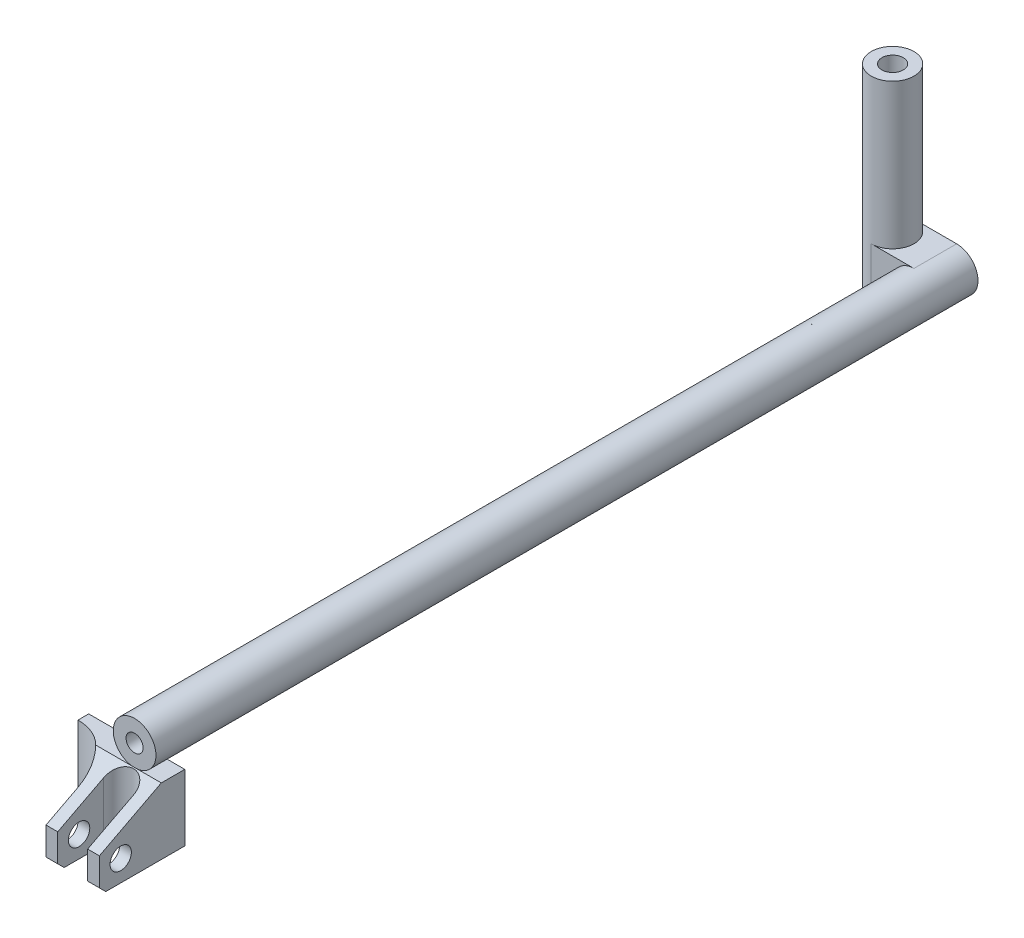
ISO-10303-21;
HEADER;
FILE_DESCRIPTION(('STEP AP214'),'2;1');
FILE_NAME('part.step','',(''),(''),'','','');
FILE_SCHEMA(('AUTOMOTIVE_DESIGN { 1 0 10303 214 1 1 1 1 }'));
ENDSEC;
DATA;
#1=APPLICATION_CONTEXT('core data for automotive mechanical design processes');
#2=APPLICATION_PROTOCOL_DEFINITION('international standard','automotive_design',2000,#1);
#3=PRODUCT_CONTEXT('',#1,'mechanical');
#4=PRODUCT('Part','Part','',(#3));
#5=PRODUCT_RELATED_PRODUCT_CATEGORY('part','',(#4));
#6=PRODUCT_DEFINITION_FORMATION('','',#4);
#7=PRODUCT_DEFINITION_CONTEXT('part definition',#1,'design');
#8=PRODUCT_DEFINITION('design','',#6,#7);
#9=PRODUCT_DEFINITION_SHAPE('','',#8);
#10=(LENGTH_UNIT() NAMED_UNIT(*) SI_UNIT(.MILLI.,.METRE.));
#11=(NAMED_UNIT(*) PLANE_ANGLE_UNIT() SI_UNIT($,.RADIAN.));
#12=(NAMED_UNIT(*) SI_UNIT($,.STERADIAN.) SOLID_ANGLE_UNIT());
#13=UNCERTAINTY_MEASURE_WITH_UNIT(LENGTH_MEASURE(1.E-05),#10,'distance_accuracy_value','');
#14=(GEOMETRIC_REPRESENTATION_CONTEXT(3) GLOBAL_UNCERTAINTY_ASSIGNED_CONTEXT((#13)) GLOBAL_UNIT_ASSIGNED_CONTEXT((#10,
#11,#12)) REPRESENTATION_CONTEXT('',''));
#15=CARTESIAN_POINT('',(0.,0.,0.));
#16=DIRECTION('',(0.,0.,1.));
#17=DIRECTION('',(1.,0.,0.));
#18=AXIS2_PLACEMENT_3D('',#15,#16,#17);
#19=CARTESIAN_POINT('',(0.,0.,0.));
#20=DIRECTION('',(0.,0.,1.));
#21=DIRECTION('',(1.,0.,0.));
#22=AXIS2_PLACEMENT_3D('',#19,#20,#21);
#23=CYLINDRICAL_SURFACE('',#22,8.);
#24=CARTESIAN_POINT('',(0.,0.,365.));
#25=DIRECTION('',(0.,0.,1.));
#26=DIRECTION('',(1.,0.,0.));
#27=AXIS2_PLACEMENT_3D('',#24,#25,#26);
#28=CIRCLE('',#27,8.);
#29=CARTESIAN_POINT('',(8.,0.,365.));
#30=VERTEX_POINT('',#29);
#31=EDGE_CURVE('E36',#30,#30,#28,.F.);
#32=ORIENTED_EDGE('',*,*,#31,.F.);
#33=EDGE_LOOP('',(#32));
#34=FACE_BOUND('',#33,.T.);
#35=CARTESIAN_POINT('',(-8.,1.11022302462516E-13,5.));
#36=CARTESIAN_POINT('',(-7.99999969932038,-0.127079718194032,5.00000029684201));
#37=CARTESIAN_POINT('',(-7.99696526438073,-0.254165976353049,5.00485122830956));
#38=CARTESIAN_POINT('',(-7.98490163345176,-0.507365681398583,5.02418745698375));
#39=CARTESIAN_POINT('',(-7.97586983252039,-0.633478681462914,5.03867694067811));
#40=CARTESIAN_POINT('',(-7.95201844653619,-0.883879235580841,5.0771121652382));
#41=CARTESIAN_POINT('',(-7.93719071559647,-1.00816396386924,5.10107121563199));
#42=CARTESIAN_POINT('',(-7.9021008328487,-1.2538800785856,5.1581302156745));
#43=CARTESIAN_POINT('',(-7.88183638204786,-1.37531023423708,5.19123403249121));
#44=CARTESIAN_POINT('',(-7.83646507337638,-1.6138367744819,5.2659676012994));
#45=CARTESIAN_POINT('',(-7.81138511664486,-1.73095311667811,5.30755006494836));
#46=CARTESIAN_POINT('',(-7.75685494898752,-1.96091650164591,5.39889847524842));
#47=CARTESIAN_POINT('',(-7.72740304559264,-2.07376186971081,5.44866759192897));
#48=CARTESIAN_POINT('',(-7.63340708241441,-2.40491190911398,5.60949664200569));
#49=CARTESIAN_POINT('',(-7.56316973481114,-2.61609848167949,5.73216345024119));
#50=CARTESIAN_POINT('',(-7.40680295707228,-3.03193014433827,6.01555395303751));
#51=CARTESIAN_POINT('',(-7.31985233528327,-3.23470598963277,6.17853453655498));
#52=CARTESIAN_POINT('',(-7.14124012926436,-3.61195776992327,6.53289939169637));
#53=CARTESIAN_POINT('',(-7.04957232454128,-3.78639500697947,6.72432183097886));
#54=CARTESIAN_POINT('',(-6.90836217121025,-4.03551059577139,7.04428574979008));
#55=CARTESIAN_POINT('',(-6.85772204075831,-4.12074022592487,7.16428713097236));
#56=CARTESIAN_POINT('',(-6.75899646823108,-4.28074637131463,7.41215103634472));
#57=CARTESIAN_POINT('',(-6.7109115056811,-4.35552092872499,7.54001502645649));
#58=CARTESIAN_POINT('',(-6.61907677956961,-4.49385262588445,7.80288418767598));
#59=CARTESIAN_POINT('',(-6.57532033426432,-4.55742717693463,7.93787784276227));
#60=CARTESIAN_POINT('',(-6.49385156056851,-4.67278116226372,8.21462244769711));
#61=CARTESIAN_POINT('',(-6.45613925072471,-4.72456056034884,8.35637341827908));
#62=CARTESIAN_POINT('',(-6.39737739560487,-4.80367778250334,8.60813358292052));
#63=CARTESIAN_POINT('',(-6.37454329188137,-4.83387146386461,8.71683605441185));
#64=CARTESIAN_POINT('',(-6.33391313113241,-4.88698936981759,8.93691914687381));
#65=CARTESIAN_POINT('',(-6.31611593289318,-4.90991524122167,9.04829915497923));
#66=CARTESIAN_POINT('',(-6.2861900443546,-4.94817199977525,9.27297633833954));
#67=CARTESIAN_POINT('',(-6.27405463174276,-4.96351189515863,9.38627107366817));
#68=CARTESIAN_POINT('',(-6.25587655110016,-4.98640391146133,9.61414129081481));
#69=CARTESIAN_POINT('',(-6.2498341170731,-4.99395573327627,9.72871682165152));
#70=CARTESIAN_POINT('',(-6.24407626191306,-5.00115324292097,9.9585586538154));
#71=CARTESIAN_POINT('',(-6.24437637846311,-5.0007795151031,10.0738259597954));
#72=CARTESIAN_POINT('',(-6.25133014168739,-4.99208386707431,10.3039059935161));
#73=CARTESIAN_POINT('',(-6.25798611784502,-4.98375903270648,10.4187185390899));
#74=CARTESIAN_POINT('',(-6.27739584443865,-4.95928874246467,10.6470210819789));
#75=CARTESIAN_POINT('',(-6.29015151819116,-4.94314081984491,10.7605106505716));
#76=CARTESIAN_POINT('',(-6.32127805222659,-4.90327193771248,10.9853862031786));
#77=CARTESIAN_POINT('',(-6.33965123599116,-4.87954784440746,11.0967712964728));
#78=CARTESIAN_POINT('',(-6.4012993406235,-4.79874186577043,11.4216199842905));
#79=CARTESIAN_POINT('',(-6.45162709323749,-4.73140686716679,11.6312924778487));
#80=CARTESIAN_POINT('',(-6.56582416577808,-4.57160139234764,12.0366820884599));
#81=CARTESIAN_POINT('',(-6.62969827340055,-4.4791220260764,12.2323942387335));
#82=CARTESIAN_POINT('',(-6.77818972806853,-4.25180409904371,12.6433146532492));
#83=CARTESIAN_POINT('',(-6.86445305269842,-4.11227978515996,12.855335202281));
#84=CARTESIAN_POINT('',(-7.04023909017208,-3.80349790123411,13.2553491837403));
#85=CARTESIAN_POINT('',(-7.12976507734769,-3.63420977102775,13.443317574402));
#86=CARTESIAN_POINT('',(-7.26825220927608,-3.34462792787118,13.7195685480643));
#87=CARTESIAN_POINT('',(-7.31856628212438,-3.23332743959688,13.816742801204));
#88=CARTESIAN_POINT('',(-7.41651405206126,-3.00184758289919,14.0013511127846));
#89=CARTESIAN_POINT('',(-7.46414873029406,-2.88167150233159,14.0887887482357));
#90=CARTESIAN_POINT('',(-7.55548277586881,-2.63291547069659,14.2532332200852));
#91=CARTESIAN_POINT('',(-7.59918109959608,-2.5043333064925,14.3302372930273));
#92=CARTESIAN_POINT('',(-7.6813840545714,-2.23953943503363,14.4729252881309));
#93=CARTESIAN_POINT('',(-7.71989188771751,-2.10333250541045,14.5386161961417));
#94=CARTESIAN_POINT('',(-7.78870197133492,-1.83158498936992,14.6546688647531));
#95=CARTESIAN_POINT('',(-7.81933279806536,-1.69639792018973,14.7056622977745));
#96=CARTESIAN_POINT('',(-7.87404113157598,-1.42097512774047,14.796020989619));
#97=CARTESIAN_POINT('',(-7.89812238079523,-1.28074233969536,14.8353928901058));
#98=CARTESIAN_POINT('',(-7.93899345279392,-0.996484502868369,14.9018673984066));
#99=CARTESIAN_POINT('',(-7.95578983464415,-0.852462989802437,14.9289810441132));
#100=CARTESIAN_POINT('',(-7.98157299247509,-0.561915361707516,14.970490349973));
#101=CARTESIAN_POINT('',(-7.99056110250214,-0.415389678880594,14.9848881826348));
#102=CARTESIAN_POINT('',(-7.99969867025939,-0.143238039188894,14.999520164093));
#103=CARTESIAN_POINT('',(-8.00096292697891,-0.0177414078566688,15.001540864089));
#104=CARTESIAN_POINT('',(-7.99758945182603,0.232966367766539,14.9961427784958));
#105=CARTESIAN_POINT('',(-7.99295210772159,0.358177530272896,14.9887246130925));
#106=CARTESIAN_POINT('',(-7.97789005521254,0.607327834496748,14.9645562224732));
#107=CARTESIAN_POINT('',(-7.96746586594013,0.731267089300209,14.9478068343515));
#108=CARTESIAN_POINT('',(-7.94108300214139,0.976969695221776,14.9052093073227));
#109=CARTESIAN_POINT('',(-7.92512423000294,1.09873300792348,14.87936100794));
#110=CARTESIAN_POINT('',(-7.88877344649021,1.33450834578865,14.8200905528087));
#111=CARTESIAN_POINT('',(-7.86858112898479,1.44863666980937,14.7870073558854));
#112=CARTESIAN_POINT('',(-7.8238453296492,1.6735023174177,14.7131109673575));
#113=CARTESIAN_POINT('',(-7.79930036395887,1.7842384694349,14.6722951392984));
#114=CARTESIAN_POINT('',(-7.71984519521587,2.11043845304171,14.5388502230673));
#115=CARTESIAN_POINT('',(-7.65908557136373,2.32007565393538,14.4351772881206));
#116=CARTESIAN_POINT('',(-7.51959499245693,2.74037159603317,14.1899279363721));
#117=CARTESIAN_POINT('',(-7.43966908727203,2.94899750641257,14.0455818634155));
#118=CARTESIAN_POINT('',(-7.27228030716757,3.34056091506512,13.7288284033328));
#119=CARTESIAN_POINT('',(-7.18480911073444,3.52346945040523,13.5563898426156));
#120=CARTESIAN_POINT('',(-6.99623419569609,3.88590040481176,13.1594550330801));
#121=CARTESIAN_POINT('',(-6.8949947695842,4.06107692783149,12.9310356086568));
#122=CARTESIAN_POINT('',(-6.70267107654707,4.37121122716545,12.4445124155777));
#123=CARTESIAN_POINT('',(-6.61157980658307,4.50619684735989,12.186429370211));
#124=CARTESIAN_POINT('',(-6.46933988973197,4.70739703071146,11.7011860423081));
#125=CARTESIAN_POINT('',(-6.41382106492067,4.78209607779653,11.4788842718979));
#126=CARTESIAN_POINT('',(-6.34656596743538,4.87056932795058,11.1364345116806));
#127=CARTESIAN_POINT('',(-6.32682054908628,4.89612834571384,11.0208098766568));
#128=CARTESIAN_POINT('',(-6.29335959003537,4.93906627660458,10.787213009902));
#129=CARTESIAN_POINT('',(-6.27964145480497,4.95644870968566,10.6692418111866));
#130=CARTESIAN_POINT('',(-6.2587264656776,4.98283345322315,10.431062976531));
#131=CARTESIAN_POINT('',(-6.25156939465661,4.99178464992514,10.3108461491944));
#132=CARTESIAN_POINT('',(-6.24422754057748,5.00096567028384,10.0698650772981));
#133=CARTESIAN_POINT('',(-6.24404272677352,5.00119553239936,9.94910083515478));
#134=CARTESIAN_POINT('',(-6.25065867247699,4.99292458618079,9.70802447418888));
#135=CARTESIAN_POINT('',(-6.25746155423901,4.98442112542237,9.58771250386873));
#136=CARTESIAN_POINT('',(-6.27774556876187,4.95884706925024,9.34860633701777));
#137=CARTESIAN_POINT('',(-6.29122660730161,4.94177659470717,9.22981211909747));
#138=CARTESIAN_POINT('',(-6.33822773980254,4.88153513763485,8.89602861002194));
#139=CARTESIAN_POINT('',(-6.37907576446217,4.82847742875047,8.68376223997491));
#140=CARTESIAN_POINT('',(-6.47669777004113,4.69670428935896,8.27142029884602));
#141=CARTESIAN_POINT('',(-6.53347839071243,4.61797815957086,8.07134985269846));
#142=CARTESIAN_POINT('',(-6.66655793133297,4.42410573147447,7.65762443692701));
#143=CARTESIAN_POINT('',(-6.74449249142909,4.30533683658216,7.4461960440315));
#144=CARTESIAN_POINT('',(-6.90670498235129,4.0400096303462,7.04424929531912));
#145=CARTESIAN_POINT('',(-6.99098800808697,3.8934288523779,6.85374804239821));
#146=CARTESIAN_POINT('',(-7.17608994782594,3.54264024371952,6.45991603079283));
#147=CARTESIAN_POINT('',(-7.27687640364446,3.33276887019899,6.26152210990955));
#148=CARTESIAN_POINT('',(-7.42018359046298,2.99268031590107,5.99189976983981));
#149=CARTESIAN_POINT('',(-7.46667962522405,2.8749841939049,5.90662168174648));
#150=CARTESIAN_POINT('',(-7.5558801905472,2.63162062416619,5.7460851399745));
#151=CARTESIAN_POINT('',(-7.59858669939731,2.5059573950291,5.67082144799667));
#152=CARTESIAN_POINT('',(-7.67916888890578,2.24695585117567,5.53089372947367));
#153=CARTESIAN_POINT('',(-7.71703260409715,2.11359966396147,5.46625584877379));
#154=CARTESIAN_POINT('',(-7.78670745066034,1.84039127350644,5.34864993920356));
#155=CARTESIAN_POINT('',(-7.81852207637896,1.70054287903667,5.2956751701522));
#156=CARTESIAN_POINT('',(-7.87506644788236,1.41574969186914,5.20228711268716));
#157=CARTESIAN_POINT('',(-7.89981525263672,1.27081981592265,5.16184000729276));
#158=CARTESIAN_POINT('',(-7.94151359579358,0.976912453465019,5.09404896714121));
#159=CARTESIAN_POINT('',(-7.95846888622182,0.827938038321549,5.06669536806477));
#160=CARTESIAN_POINT('',(-7.9807660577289,0.56570803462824,5.03081849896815));
#161=CARTESIAN_POINT('',(-7.98796542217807,0.453012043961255,5.01927449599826));
#162=CARTESIAN_POINT('',(-7.99758267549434,0.226879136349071,5.00386487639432));
#163=CARTESIAN_POINT('',(-8.00000026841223,0.113442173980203,4.99999973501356));
#164=CARTESIAN_POINT('',(-8.,1.11022302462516E-13,5.));
#165=B_SPLINE_CURVE_WITH_KNOTS('',3,(#35,#36,#37,#38,#39,#40,#41,#42,#43,#44,#45,#46,#47,#48,
#49,#50,#51,#52,#53,#54,#55,#56,#57,#58,#59,#60,#61,#62,#63,#64,#65,#66,#67,#68,#69,#70,#71,#72,
#73,#74,#75,#76,#77,#78,#79,#80,#81,#82,#83,#84,#85,#86,#87,#88,#89,#90,#91,#92,#93,#94,#95,#96,
#97,#98,#99,#100,#101,#102,#103,#104,#105,#106,#107,#108,#109,#110,#111,#112,#113,#114,#115,
#116,#117,#118,#119,#120,#121,#122,#123,#124,#125,#126,#127,#128,#129,#130,#131,#132,#133,#134,
#135,#136,#137,#138,#139,#140,#141,#142,#143,#144,#145,#146,#147,#148,#149,#150,#151,#152,#153,
#154,#155,#156,#157,#158,#159,#160,#161,#162,#163,#164),.UNSPECIFIED.,.T.,.F.,(4,2,2,2,2,2,2,2,
2,2,2,2,2,2,2,2,2,2,2,2,2,2,2,2,2,2,2,2,2,2,2,2,2,2,2,2,2,2,2,2,2,2,2,2,2,2,2,2,2,2,2,2,2,2,2,2,
2,2,2,2,2,2,2,2,4),(0.,0.381122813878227,0.762411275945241,1.14423755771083,1.52622555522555,
1.90613865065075,2.28619920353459,3.04547146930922,3.86537873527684,4.68639638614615,
5.15288943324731,5.61946971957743,6.0853181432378,6.55116799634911,6.89615022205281,
7.24105422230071,7.58554766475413,7.93005433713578,8.27540506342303,8.62088241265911,
8.96646876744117,9.31219825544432,9.98712845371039,10.6622975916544,11.463592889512,
12.2657157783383,12.7334704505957,13.2010527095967,13.6687585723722,14.1361745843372,
14.5786070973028,15.0207862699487,15.4625664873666,15.9042712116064,16.280349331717,
16.6564027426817,17.0324224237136,17.4084487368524,17.7696430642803,18.1309607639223,
18.8530325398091,19.6479898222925,20.4438353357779,21.355208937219,22.2659496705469,
22.9857781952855,23.3455439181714,23.705154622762,24.0669316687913,24.4287071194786,
24.7905924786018,25.1524727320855,25.8172983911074,26.4824015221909,27.2437925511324,
28.005801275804,28.9187931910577,29.3761295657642,29.8332257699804,30.2914303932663,
30.749369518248,31.2060614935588,31.6624158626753,32.0026174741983,32.3428401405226),.UNSPECIFIED.);
#166=CARTESIAN_POINT('',(-8.,1.11022302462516E-13,5.));
#167=VERTEX_POINT('',#166);
#168=EDGE_CURVE('E195',#167,#167,#165,.T.);
#169=ORIENTED_EDGE('',*,*,#168,.T.);
#170=EDGE_LOOP('',(#169));
#171=FACE_BOUND('',#170,.T.);
#172=CARTESIAN_POINT('',(0.,0.,3.));
#173=DIRECTION('',(0.,0.,-1.));
#174=DIRECTION('',(-1.,0.,0.));
#175=AXIS2_PLACEMENT_3D('',#172,#173,#174);
#176=CIRCLE('',#175,8.);
#177=CARTESIAN_POINT('',(-8.,0.,3.));
#178=VERTEX_POINT('',#177);
#179=EDGE_CURVE('E11',#178,#178,#176,.F.);
#180=ORIENTED_EDGE('',*,*,#179,.F.);
#181=EDGE_LOOP('',(#180));
#182=FACE_BOUND('',#181,.T.);
#183=ADVANCED_FACE('F28',(#34,#171,#182),#23,.F.);
#184=CARTESIAN_POINT('',(-25.,1.11022302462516E-13,10.));
#185=DIRECTION('',(1.,0.,0.));
#186=DIRECTION('',(0.,0.,-1.));
#187=AXIS2_PLACEMENT_3D('',#184,#185,#186);
#188=CYLINDRICAL_SURFACE('',#187,5.);
#189=ORIENTED_EDGE('',*,*,#168,.F.);
#190=EDGE_LOOP('',(#189));
#191=FACE_BOUND('',#190,.T.);
#192=CARTESIAN_POINT('',(-20.,1.11022302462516E-13,10.));
#193=DIRECTION('',(0.707106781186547,-0.707106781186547,0.));
#194=DIRECTION('',(0.707106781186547,0.707106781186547,0.));
#195=AXIS2_PLACEMENT_3D('',#192,#193,#194);
#196=ELLIPSE('',#195,7.07106781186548,5.);
#197=CARTESIAN_POINT('',(-20.,1.11022302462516E-13,15.));
#198=VERTEX_POINT('',#197);
#199=CARTESIAN_POINT('',(-20.,1.11022302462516E-13,5.));
#200=VERTEX_POINT('',#199);
#201=EDGE_CURVE('E187',#198,#200,#196,.F.);
#202=ORIENTED_EDGE('',*,*,#201,.T.);
#203=CARTESIAN_POINT('',(-20.,1.11022302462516E-13,10.));
#204=DIRECTION('',(0.707106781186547,0.707106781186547,0.));
#205=DIRECTION('',(0.707106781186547,-0.707106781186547,0.));
#206=AXIS2_PLACEMENT_3D('',#203,#204,#205);
#207=ELLIPSE('',#206,7.07106781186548,5.);
#208=EDGE_CURVE('E190',#200,#198,#207,.F.);
#209=ORIENTED_EDGE('',*,*,#208,.T.);
#210=EDGE_LOOP('',(#202,#209));
#211=FACE_BOUND('',#210,.T.);
#212=ADVANCED_FACE('F387',(#191,#211),#188,.F.);
#213=CARTESIAN_POINT('',(-32.5,-25.,414.));
#214=DIRECTION('',(0.,0.,1.));
#215=DIRECTION('',(1.,0.,0.));
#216=AXIS2_PLACEMENT_3D('',#213,#214,#215);
#217=PLANE('',#216);
#218=DIRECTION('',(0.,1.,0.));
#219=VECTOR('',#218,1.);
#220=CARTESIAN_POINT('',(6.99999999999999,-25.,414.));
#221=LINE('',#220,#219);
#222=CARTESIAN_POINT('',(6.99999999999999,-38.,414.));
#223=VERTEX_POINT('',#222);
#224=CARTESIAN_POINT('',(6.99999999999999,-25.,414.));
#225=VERTEX_POINT('',#224);
#226=EDGE_CURVE('E234',#223,#225,#221,.T.);
#227=ORIENTED_EDGE('',*,*,#226,.F.);
#228=DIRECTION('',(1.,0.,0.));
#229=VECTOR('',#228,1.);
#230=CARTESIAN_POINT('',(-32.5,-38.,414.));
#231=LINE('',#230,#229);
#232=CARTESIAN_POINT('',(12.5,-38.,414.));
#233=VERTEX_POINT('',#232);
#234=EDGE_CURVE('E353',#223,#233,#231,.T.);
#235=ORIENTED_EDGE('',*,*,#234,.T.);
#236=DIRECTION('',(0.,-1.,0.));
#237=VECTOR('',#236,1.);
#238=CARTESIAN_POINT('',(12.5,-25.,414.));
#239=LINE('',#238,#237);
#240=CARTESIAN_POINT('',(12.5,-25.,414.));
#241=VERTEX_POINT('',#240);
#242=EDGE_CURVE('E258',#241,#233,#239,.T.);
#243=ORIENTED_EDGE('',*,*,#242,.F.);
#244=DIRECTION('',(1.,0.,0.));
#245=VECTOR('',#244,1.);
#246=CARTESIAN_POINT('',(-32.5,-25.,414.));
#247=LINE('',#246,#245);
#248=EDGE_CURVE('E285',#225,#241,#247,.T.);
#249=ORIENTED_EDGE('',*,*,#248,.F.);
#250=EDGE_LOOP('',(#227,#235,#243,#249));
#251=FACE_BOUND('',#250,.T.);
#252=ADVANCED_FACE('F408',(#251),#217,.T.);
#253=CARTESIAN_POINT('',(-20.,10.,10.));
#254=DIRECTION('',(0.,1.,0.));
#255=DIRECTION('',(0.,0.,1.));
#256=AXIS2_PLACEMENT_3D('',#253,#254,#255);
#257=PLANE('',#256);
#258=DIRECTION('',(-1.,0.,0.));
#259=VECTOR('',#258,1.);
#260=CARTESIAN_POINT('',(-20.,10.,0.));
#261=LINE('',#260,#259);
#262=CARTESIAN_POINT('',(0.,10.,0.));
#263=VERTEX_POINT('',#262);
#264=CARTESIAN_POINT('',(-20.,10.,0.));
#265=VERTEX_POINT('',#264);
#266=EDGE_CURVE('E320',#263,#265,#261,.T.);
#267=ORIENTED_EDGE('',*,*,#266,.T.);
#268=CARTESIAN_POINT('',(-20.,10.,10.));
#269=DIRECTION('',(0.,1.,0.));
#270=DIRECTION('',(0.,0.,1.));
#271=AXIS2_PLACEMENT_3D('',#268,#269,#270);
#272=CIRCLE('',#271,10.);
#273=CARTESIAN_POINT('',(-20.,10.,20.));
#274=VERTEX_POINT('',#273);
#275=EDGE_CURVE('E293',#274,#265,#272,.T.);
#276=ORIENTED_EDGE('',*,*,#275,.F.);
#277=DIRECTION('',(1.,0.,0.));
#278=VECTOR('',#277,1.);
#279=CARTESIAN_POINT('',(-20.,10.,20.));
#280=LINE('',#279,#278);
#281=CARTESIAN_POINT('',(0.,10.,20.));
#282=VERTEX_POINT('',#281);
#283=EDGE_CURVE('E314',#274,#282,#280,.T.);
#284=ORIENTED_EDGE('',*,*,#283,.T.);
#285=DIRECTION('',(0.,0.,-1.));
#286=VECTOR('',#285,1.);
#287=CARTESIAN_POINT('',(0.,10.,0.));
#288=LINE('',#287,#286);
#289=EDGE_CURVE('E317',#282,#263,#288,.T.);
#290=ORIENTED_EDGE('',*,*,#289,.T.);
#291=EDGE_LOOP('',(#267,#276,#284,#290));
#292=FACE_BOUND('',#291,.T.);
#293=ADVANCED_FACE('F585',(#292),#257,.T.);
#294=CARTESIAN_POINT('',(-20.,-10.,10.));
#295=DIRECTION('',(0.,1.,0.));
#296=DIRECTION('',(0.,0.,1.));
#297=AXIS2_PLACEMENT_3D('',#294,#295,#296);
#298=PLANE('',#297);
#299=CARTESIAN_POINT('',(-20.,-10.,10.));
#300=DIRECTION('',(0.,-1.,0.));
#301=DIRECTION('',(0.,0.,-1.));
#302=AXIS2_PLACEMENT_3D('',#299,#300,#301);
#303=CIRCLE('',#302,10.);
#304=CARTESIAN_POINT('',(-20.,-10.,0.));
#305=VERTEX_POINT('',#304);
#306=CARTESIAN_POINT('',(-20.,-10.,20.));
#307=VERTEX_POINT('',#306);
#308=EDGE_CURVE('E299',#305,#307,#303,.T.);
#309=ORIENTED_EDGE('',*,*,#308,.F.);
#310=DIRECTION('',(-1.,0.,0.));
#311=VECTOR('',#310,1.);
#312=CARTESIAN_POINT('',(-20.,-10.,0.));
#313=LINE('',#312,#311);
#314=CARTESIAN_POINT('',(0.,-10.,0.));
#315=VERTEX_POINT('',#314);
#316=EDGE_CURVE('E311',#315,#305,#313,.T.);
#317=ORIENTED_EDGE('',*,*,#316,.F.);
#318=DIRECTION('',(0.,0.,-1.));
#319=VECTOR('',#318,1.);
#320=CARTESIAN_POINT('',(0.,-10.,0.));
#321=LINE('',#320,#319);
#322=CARTESIAN_POINT('',(0.,-10.,20.));
#323=VERTEX_POINT('',#322);
#324=EDGE_CURVE('E308',#323,#315,#321,.T.);
#325=ORIENTED_EDGE('',*,*,#324,.F.);
#326=DIRECTION('',(1.,0.,0.));
#327=VECTOR('',#326,1.);
#328=CARTESIAN_POINT('',(-20.,-10.,20.));
#329=LINE('',#328,#327);
#330=EDGE_CURVE('E305',#307,#323,#329,.T.);
#331=ORIENTED_EDGE('',*,*,#330,.F.);
#332=EDGE_LOOP('',(#309,#317,#325,#331));
#333=FACE_BOUND('',#332,.T.);
#334=ADVANCED_FACE('F479',(#333),#298,.F.);
#335=CARTESIAN_POINT('',(0.,0.,385.));
#336=DIRECTION('',(0.,0.,-1.));
#337=DIRECTION('',(-1.,0.,0.));
#338=AXIS2_PLACEMENT_3D('',#335,#336,#337);
#339=CYLINDRICAL_SURFACE('',#338,10.);
#340=CARTESIAN_POINT('',(0.,0.,385.));
#341=DIRECTION('',(0.,0.,1.));
#342=DIRECTION('',(1.,0.,0.));
#343=AXIS2_PLACEMENT_3D('',#340,#341,#342);
#344=CIRCLE('',#343,10.);
#345=CARTESIAN_POINT('',(1.26901134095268,-9.91915370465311,385.));
#346=VERTEX_POINT('',#345);
#347=CARTESIAN_POINT('',(-1.26901134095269,-9.91915370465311,385.));
#348=VERTEX_POINT('',#347);
#349=EDGE_CURVE('E329',#346,#348,#344,.T.);
#350=ORIENTED_EDGE('',*,*,#349,.F.);
#351=DIRECTION('',(0.,0.,-1.));
#352=VECTOR('',#351,1.);
#353=CARTESIAN_POINT('',(1.26901134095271,-9.91915370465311,385.));
#354=LINE('',#353,#352);
#355=CARTESIAN_POINT('',(1.26901134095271,-9.9191537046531,374.));
#356=VERTEX_POINT('',#355);
#357=EDGE_CURVE('E290',#346,#356,#354,.T.);
#358=ORIENTED_EDGE('',*,*,#357,.T.);
#359=CARTESIAN_POINT('',(0.,0.,374.));
#360=DIRECTION('',(0.,0.,-1.));
#361=DIRECTION('',(-1.,0.,0.));
#362=AXIS2_PLACEMENT_3D('',#359,#360,#361);
#363=CIRCLE('',#362,10.);
#364=CARTESIAN_POINT('',(-1.26901134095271,-9.9191537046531,374.));
#365=VERTEX_POINT('',#364);
#366=EDGE_CURVE('E337',#356,#365,#363,.T.);
#367=ORIENTED_EDGE('',*,*,#366,.T.);
#368=DIRECTION('',(0.,0.,-1.));
#369=VECTOR('',#368,1.);
#370=CARTESIAN_POINT('',(-1.26901134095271,-9.91915370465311,385.));
#371=LINE('',#370,#369);
#372=EDGE_CURVE('E277',#365,#348,#371,.F.);
#373=ORIENTED_EDGE('',*,*,#372,.T.);
#374=EDGE_LOOP('',(#350,#358,#367,#373));
#375=FACE_BOUND('',#374,.T.);
#376=ORIENTED_EDGE('',*,*,#289,.F.);
#377=CARTESIAN_POINT('',(0.,0.,20.));
#378=DIRECTION('',(0.,0.,-1.));
#379=DIRECTION('',(-1.,0.,0.));
#380=AXIS2_PLACEMENT_3D('',#377,#378,#379);
#381=CIRCLE('',#380,10.);
#382=EDGE_CURVE('E332',#323,#282,#381,.T.);
#383=ORIENTED_EDGE('',*,*,#382,.F.);
#384=ORIENTED_EDGE('',*,*,#324,.T.);
#385=CARTESIAN_POINT('',(0.,0.,0.));
#386=DIRECTION('',(0.,0.,1.));
#387=DIRECTION('',(1.,0.,0.));
#388=AXIS2_PLACEMENT_3D('',#385,#386,#387);
#389=CIRCLE('',#388,10.);
#390=EDGE_CURVE('E327',#315,#263,#389,.T.);
#391=ORIENTED_EDGE('',*,*,#390,.T.);
#392=EDGE_LOOP('',(#376,#383,#384,#391));
#393=FACE_BOUND('',#392,.T.);
#394=ADVANCED_FACE('F30',(#375,#393),#339,.T.);
#395=CARTESIAN_POINT('',(0.,0.,385.));
#396=DIRECTION('',(0.,0.,1.));
#397=DIRECTION('',(1.,0.,0.));
#398=AXIS2_PLACEMENT_3D('',#395,#396,#397);
#399=PLANE('',#398);
#400=DIRECTION('',(-1.,0.,0.));
#401=VECTOR('',#400,1.);
#402=CARTESIAN_POINT('',(0.,-9.91915370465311,385.));
#403=LINE('',#402,#401);
#404=EDGE_CURVE('E334',#346,#348,#403,.T.);
#405=ORIENTED_EDGE('',*,*,#404,.F.);
#406=ORIENTED_EDGE('',*,*,#349,.T.);
#407=EDGE_LOOP('',(#405,#406));
#408=FACE_BOUND('',#407,.T.);
#409=CARTESIAN_POINT('',(0.,0.,385.));
#410=DIRECTION('',(0.,0.,1.));
#411=DIRECTION('',(1.,0.,0.));
#412=AXIS2_PLACEMENT_3D('',#409,#410,#411);
#413=CIRCLE('',#412,4.);
#414=CARTESIAN_POINT('',(4.,0.,385.));
#415=VERTEX_POINT('',#414);
#416=EDGE_CURVE('E202',#415,#415,#413,.T.);
#417=ORIENTED_EDGE('',*,*,#416,.F.);
#418=EDGE_LOOP('',(#417));
#419=FACE_BOUND('',#418,.T.);
#420=ADVANCED_FACE('F472',(#408,#419),#399,.T.);
#421=CARTESIAN_POINT('',(0.,0.,0.));
#422=DIRECTION('',(0.,0.,1.));
#423=DIRECTION('',(1.,0.,0.));
#424=AXIS2_PLACEMENT_3D('',#421,#422,#423);
#425=PLANE('',#424);
#426=ORIENTED_EDGE('',*,*,#390,.F.);
#427=ORIENTED_EDGE('',*,*,#316,.T.);
#428=DIRECTION('',(0.,-1.,0.));
#429=VECTOR('',#428,1.);
#430=CARTESIAN_POINT('',(-20.,10.,0.));
#431=LINE('',#430,#429);
#432=EDGE_CURVE('E323',#265,#305,#431,.T.);
#433=ORIENTED_EDGE('',*,*,#432,.F.);
#434=ORIENTED_EDGE('',*,*,#266,.F.);
#435=EDGE_LOOP('',(#426,#427,#433,#434));
#436=FACE_BOUND('',#435,.T.);
#437=ADVANCED_FACE('F465',(#436),#425,.F.);
#438=CARTESIAN_POINT('',(-20.,10.,20.));
#439=DIRECTION('',(0.,0.,-1.));
#440=DIRECTION('',(-1.,0.,0.));
#441=AXIS2_PLACEMENT_3D('',#438,#439,#440);
#442=PLANE('',#441);
#443=ORIENTED_EDGE('',*,*,#330,.T.);
#444=ORIENTED_EDGE('',*,*,#382,.T.);
#445=ORIENTED_EDGE('',*,*,#283,.F.);
#446=DIRECTION('',(0.,-1.,0.));
#447=VECTOR('',#446,1.);
#448=CARTESIAN_POINT('',(-20.,10.,20.));
#449=LINE('',#448,#447);
#450=EDGE_CURVE('E325',#274,#307,#449,.T.);
#451=ORIENTED_EDGE('',*,*,#450,.T.);
#452=EDGE_LOOP('',(#443,#444,#445,#451));
#453=FACE_BOUND('',#452,.T.);
#454=ADVANCED_FACE('F456',(#453),#442,.F.);
#455=CARTESIAN_POINT('',(-20.,10.,10.));
#456=DIRECTION('',(0.,-1.,0.));
#457=DIRECTION('',(0.,0.,-1.));
#458=AXIS2_PLACEMENT_3D('',#455,#456,#457);
#459=CYLINDRICAL_SURFACE('',#458,10.);
#460=ORIENTED_EDGE('',*,*,#432,.T.);
#461=ORIENTED_EDGE('',*,*,#308,.T.);
#462=ORIENTED_EDGE('',*,*,#450,.F.);
#463=ORIENTED_EDGE('',*,*,#275,.T.);
#464=EDGE_LOOP('',(#460,#461,#462,#463));
#465=FACE_BOUND('',#464,.T.);
#466=CARTESIAN_POINT('',(-20.,-13.,10.));
#467=DIRECTION('',(0.,-1.,0.));
#468=DIRECTION('',(0.,0.,-1.));
#469=AXIS2_PLACEMENT_3D('',#466,#467,#468);
#470=CIRCLE('',#469,10.);
#471=CARTESIAN_POINT('',(-20.,-13.,0.));
#472=VERTEX_POINT('',#471);
#473=EDGE_CURVE('E302',#472,#472,#470,.T.);
#474=ORIENTED_EDGE('',*,*,#473,.F.);
#475=EDGE_LOOP('',(#474));
#476=FACE_BOUND('',#475,.T.);
#477=CARTESIAN_POINT('',(-20.,78.,10.));
#478=DIRECTION('',(0.,1.,0.));
#479=DIRECTION('',(0.,0.,1.));
#480=AXIS2_PLACEMENT_3D('',#477,#478,#479);
#481=CIRCLE('',#480,10.);
#482=CARTESIAN_POINT('',(-20.,78.,20.));
#483=VERTEX_POINT('',#482);
#484=EDGE_CURVE('E296',#483,#483,#481,.T.);
#485=ORIENTED_EDGE('',*,*,#484,.F.);
#486=EDGE_LOOP('',(#485));
#487=FACE_BOUND('',#486,.T.);
#488=ADVANCED_FACE('F454',(#465,#476,#487),#459,.T.);
#489=CARTESIAN_POINT('',(-20.,-13.,10.));
#490=DIRECTION('',(0.,-1.,0.));
#491=DIRECTION('',(0.,0.,-1.));
#492=AXIS2_PLACEMENT_3D('',#489,#490,#491);
#493=PLANE('',#492);
#494=ORIENTED_EDGE('',*,*,#473,.T.);
#495=EDGE_LOOP('',(#494));
#496=FACE_BOUND('',#495,.T.);
#497=ADVANCED_FACE('F450',(#496),#493,.T.);
#498=CARTESIAN_POINT('',(-20.,78.,10.));
#499=DIRECTION('',(0.,1.,0.));
#500=DIRECTION('',(0.,0.,1.));
#501=AXIS2_PLACEMENT_3D('',#498,#499,#500);
#502=PLANE('',#501);
#503=CARTESIAN_POINT('',(-20.,78.,10.));
#504=DIRECTION('',(0.,1.,0.));
#505=DIRECTION('',(0.,0.,1.));
#506=AXIS2_PLACEMENT_3D('',#503,#504,#505);
#507=CIRCLE('',#506,5.);
#508=CARTESIAN_POINT('',(-20.,78.,15.));
#509=VERTEX_POINT('',#508);
#510=EDGE_CURVE('E438',#509,#509,#507,.T.);
#511=ORIENTED_EDGE('',*,*,#510,.F.);
#512=EDGE_LOOP('',(#511));
#513=FACE_BOUND('',#512,.T.);
#514=ORIENTED_EDGE('',*,*,#484,.T.);
#515=EDGE_LOOP('',(#514));
#516=FACE_BOUND('',#515,.T.);
#517=ADVANCED_FACE('F446',(#513,#516),#502,.T.);
#518=CARTESIAN_POINT('',(-32.5,-41.,374.));
#519=DIRECTION('',(0.,0.,-1.));
#520=DIRECTION('',(-1.,0.,0.));
#521=AXIS2_PLACEMENT_3D('',#518,#519,#520);
#522=PLANE('',#521);
#523=ORIENTED_EDGE('',*,*,#366,.F.);
#524=DIRECTION('',(1.,0.,0.));
#525=VECTOR('',#524,1.);
#526=CARTESIAN_POINT('',(-32.5,-9.91915370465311,374.));
#527=LINE('',#526,#525);
#528=CARTESIAN_POINT('',(12.5,-9.91915370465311,374.));
#529=VERTEX_POINT('',#528);
#530=EDGE_CURVE('E278',#356,#529,#527,.T.);
#531=ORIENTED_EDGE('',*,*,#530,.T.);
#532=DIRECTION('',(0.,1.,0.));
#533=VECTOR('',#532,1.);
#534=CARTESIAN_POINT('',(12.5,-41.,374.));
#535=LINE('',#534,#533);
#536=CARTESIAN_POINT('',(12.5,-41.,374.));
#537=VERTEX_POINT('',#536);
#538=EDGE_CURVE('E263',#537,#529,#535,.T.);
#539=ORIENTED_EDGE('',*,*,#538,.F.);
#540=DIRECTION('',(1.,0.,0.));
#541=VECTOR('',#540,1.);
#542=CARTESIAN_POINT('',(-32.5,-41.,374.));
#543=LINE('',#542,#541);
#544=CARTESIAN_POINT('',(-32.5,-41.,374.));
#545=VERTEX_POINT('',#544);
#546=EDGE_CURVE('E279',#545,#537,#543,.T.);
#547=ORIENTED_EDGE('',*,*,#546,.F.);
#548=DIRECTION('',(0.,1.,0.));
#549=VECTOR('',#548,1.);
#550=CARTESIAN_POINT('',(-32.5,-41.,374.));
#551=LINE('',#550,#549);
#552=CARTESIAN_POINT('',(-32.5,-9.91915370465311,374.));
#553=VERTEX_POINT('',#552);
#554=EDGE_CURVE('E271',#545,#553,#551,.T.);
#555=ORIENTED_EDGE('',*,*,#554,.T.);
#556=EDGE_CURVE('E275',#553,#365,#527,.T.);
#557=ORIENTED_EDGE('',*,*,#556,.T.);
#558=EDGE_LOOP('',(#523,#531,#539,#547,#555,#557));
#559=FACE_BOUND('',#558,.T.);
#560=ADVANCED_FACE('F449',(#559),#522,.T.);
#561=CARTESIAN_POINT('',(-32.5,-9.91915370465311,374.));
#562=DIRECTION('',(0.,1.,0.));
#563=DIRECTION('',(0.,0.,1.));
#564=AXIS2_PLACEMENT_3D('',#561,#562,#563);
#565=PLANE('',#564);
#566=ORIENTED_EDGE('',*,*,#357,.F.);
#567=DIRECTION('',(1.,0.,0.));
#568=VECTOR('',#567,1.);
#569=CARTESIAN_POINT('',(-32.5,-9.91915370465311,385.));
#570=LINE('',#569,#568);
#571=CARTESIAN_POINT('',(12.5,-9.91915370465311,385.));
#572=VERTEX_POINT('',#571);
#573=EDGE_CURVE('E274',#346,#572,#570,.T.);
#574=ORIENTED_EDGE('',*,*,#573,.T.);
#575=DIRECTION('',(0.,0.,1.));
#576=VECTOR('',#575,1.);
#577=CARTESIAN_POINT('',(12.5,-9.91915370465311,374.));
#578=LINE('',#577,#576);
#579=EDGE_CURVE('E253',#529,#572,#578,.T.);
#580=ORIENTED_EDGE('',*,*,#579,.F.);
#581=ORIENTED_EDGE('',*,*,#530,.F.);
#582=EDGE_LOOP('',(#566,#574,#580,#581));
#583=FACE_BOUND('',#582,.T.);
#584=ADVANCED_FACE('F491',(#583),#565,.T.);
#585=CARTESIAN_POINT('',(-32.5,-9.9191537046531,399.));
#586=DIRECTION('',(0.,1.,0.));
#587=DIRECTION('',(0.,0.,1.));
#588=AXIS2_PLACEMENT_3D('',#585,#586,#587);
#589=CIRCLE('',#588,20.);
#590=CARTESIAN_POINT('',(-18.2171431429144,-9.91915370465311,385.));
#591=VERTEX_POINT('',#590);
#592=CARTESIAN_POINT('',(-32.5,-9.91915370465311,379.));
#593=VERTEX_POINT('',#592);
#594=EDGE_CURVE('E248',#591,#593,#589,.T.);
#595=ORIENTED_EDGE('',*,*,#594,.F.);
#596=EDGE_CURVE('E286',#591,#348,#570,.T.);
#597=ORIENTED_EDGE('',*,*,#596,.T.);
#598=ORIENTED_EDGE('',*,*,#372,.F.);
#599=ORIENTED_EDGE('',*,*,#556,.F.);
#600=DIRECTION('',(0.,0.,1.));
#601=VECTOR('',#600,1.);
#602=CARTESIAN_POINT('',(-32.5,-9.91915370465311,374.));
#603=LINE('',#602,#601);
#604=EDGE_CURVE('E266',#553,#593,#603,.T.);
#605=ORIENTED_EDGE('',*,*,#604,.T.);
#606=EDGE_LOOP('',(#595,#597,#598,#599,#605));
#607=FACE_BOUND('',#606,.T.);
#608=ADVANCED_FACE('F499',(#607),#565,.T.);
#609=CARTESIAN_POINT('',(-32.5,-41.,414.));
#610=DIRECTION('',(0.,-1.,0.));
#611=DIRECTION('',(0.,0.,-1.));
#612=AXIS2_PLACEMENT_3D('',#609,#610,#611);
#613=PLANE('',#612);
#614=DIRECTION('',(0.,0.,-1.));
#615=VECTOR('',#614,1.);
#616=CARTESIAN_POINT('',(12.5,-41.,414.));
#617=LINE('',#616,#615);
#618=CARTESIAN_POINT('',(12.5,-41.,411.));
#619=VERTEX_POINT('',#618);
#620=EDGE_CURVE('E261',#619,#537,#617,.T.);
#621=ORIENTED_EDGE('',*,*,#620,.F.);
#622=DIRECTION('',(-1.,0.,0.));
#623=VECTOR('',#622,1.);
#624=CARTESIAN_POINT('',(-32.5,-41.,411.));
#625=LINE('',#624,#623);
#626=CARTESIAN_POINT('',(6.99999999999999,-41.,411.));
#627=VERTEX_POINT('',#626);
#628=EDGE_CURVE('E363',#619,#627,#625,.T.);
#629=ORIENTED_EDGE('',*,*,#628,.T.);
#630=DIRECTION('',(0.,0.,1.));
#631=VECTOR('',#630,1.);
#632=CARTESIAN_POINT('',(7.,-41.,420.621211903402));
#633=LINE('',#632,#631);
#634=CARTESIAN_POINT('',(7.,-41.,392.460683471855));
#635=VERTEX_POINT('',#634);
#636=EDGE_CURVE('E224',#635,#627,#633,.T.);
#637=ORIENTED_EDGE('',*,*,#636,.F.);
#638=CARTESIAN_POINT('',(0.,-41.,392.460683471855));
#639=DIRECTION('',(0.,-1.,0.));
#640=DIRECTION('',(0.,0.,-1.));
#641=AXIS2_PLACEMENT_3D('',#638,#639,#640);
#642=CIRCLE('',#641,7.);
#643=CARTESIAN_POINT('',(-7.,-41.,392.460683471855));
#644=VERTEX_POINT('',#643);
#645=EDGE_CURVE('E221',#644,#635,#642,.T.);
#646=ORIENTED_EDGE('',*,*,#645,.F.);
#647=DIRECTION('',(0.,0.,-1.));
#648=VECTOR('',#647,1.);
#649=CARTESIAN_POINT('',(-7.00000000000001,-41.,420.621211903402));
#650=LINE('',#649,#648);
#651=CARTESIAN_POINT('',(-7.00000000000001,-41.,411.));
#652=VERTEX_POINT('',#651);
#653=EDGE_CURVE('E218',#652,#644,#650,.T.);
#654=ORIENTED_EDGE('',*,*,#653,.F.);
#655=DIRECTION('',(-1.,0.,0.));
#656=VECTOR('',#655,1.);
#657=CARTESIAN_POINT('',(-32.5,-41.,411.));
#658=LINE('',#657,#656);
#659=CARTESIAN_POINT('',(-12.5,-41.,411.));
#660=VERTEX_POINT('',#659);
#661=EDGE_CURVE('E360',#652,#660,#658,.T.);
#662=ORIENTED_EDGE('',*,*,#661,.T.);
#663=DIRECTION('',(0.,0.,1.));
#664=VECTOR('',#663,1.);
#665=CARTESIAN_POINT('',(-12.5,-41.,399.));
#666=LINE('',#665,#664);
#667=CARTESIAN_POINT('',(-12.5,-41.,399.));
#668=VERTEX_POINT('',#667);
#669=EDGE_CURVE('E240',#668,#660,#666,.T.);
#670=ORIENTED_EDGE('',*,*,#669,.F.);
#671=CARTESIAN_POINT('',(-32.5,-41.,399.));
#672=DIRECTION('',(0.,-1.,0.));
#673=DIRECTION('',(0.,0.,1.));
#674=AXIS2_PLACEMENT_3D('',#671,#672,#673);
#675=CIRCLE('',#674,20.);
#676=CARTESIAN_POINT('',(-32.5,-41.,379.));
#677=VERTEX_POINT('',#676);
#678=EDGE_CURVE('E237',#677,#668,#675,.T.);
#679=ORIENTED_EDGE('',*,*,#678,.F.);
#680=DIRECTION('',(0.,0.,-1.));
#681=VECTOR('',#680,1.);
#682=CARTESIAN_POINT('',(-32.5,-41.,414.));
#683=LINE('',#682,#681);
#684=EDGE_CURVE('E269',#677,#545,#683,.T.);
#685=ORIENTED_EDGE('',*,*,#684,.T.);
#686=ORIENTED_EDGE('',*,*,#546,.T.);
#687=EDGE_LOOP('',(#621,#629,#637,#646,#654,#662,#670,#679,#685,#686));
#688=FACE_BOUND('',#687,.T.);
#689=ADVANCED_FACE('F541',(#688),#613,.T.);
#690=DIRECTION('',(0.,1.,0.));
#691=VECTOR('',#690,1.);
#692=CARTESIAN_POINT('',(-12.5,-25.,414.));
#693=LINE('',#692,#691);
#694=CARTESIAN_POINT('',(-12.5,-38.,414.));
#695=VERTEX_POINT('',#694);
#696=CARTESIAN_POINT('',(-12.5,-25.,414.));
#697=VERTEX_POINT('',#696);
#698=EDGE_CURVE('E251',#695,#697,#693,.T.);
#699=ORIENTED_EDGE('',*,*,#698,.F.);
#700=DIRECTION('',(1.,0.,0.));
#701=VECTOR('',#700,1.);
#702=CARTESIAN_POINT('',(-32.5,-38.,414.));
#703=LINE('',#702,#701);
#704=CARTESIAN_POINT('',(-7.00000000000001,-38.,414.));
#705=VERTEX_POINT('',#704);
#706=EDGE_CURVE('E368',#695,#705,#703,.T.);
#707=ORIENTED_EDGE('',*,*,#706,.T.);
#708=DIRECTION('',(0.,-1.,0.));
#709=VECTOR('',#708,1.);
#710=CARTESIAN_POINT('',(-7.00000000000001,-25.,414.));
#711=LINE('',#710,#709);
#712=CARTESIAN_POINT('',(-7.00000000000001,-25.,414.));
#713=VERTEX_POINT('',#712);
#714=EDGE_CURVE('E230',#713,#705,#711,.T.);
#715=ORIENTED_EDGE('',*,*,#714,.F.);
#716=EDGE_CURVE('E282',#697,#713,#247,.T.);
#717=ORIENTED_EDGE('',*,*,#716,.F.);
#718=EDGE_LOOP('',(#699,#707,#715,#717));
#719=FACE_BOUND('',#718,.T.);
#720=ADVANCED_FACE('F508',(#719),#217,.T.);
#721=CARTESIAN_POINT('',(-32.5,-9.91915370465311,385.));
#722=DIRECTION('',(0.,0.887206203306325,0.461373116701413));
#723=DIRECTION('',(0.,-0.461373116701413,0.887206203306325));
#724=AXIS2_PLACEMENT_3D('',#721,#722,#723);
#725=PLANE('',#724);
#726=DIRECTION('',(0.,0.461373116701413,-0.887206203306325));
#727=VECTOR('',#726,1.);
#728=CARTESIAN_POINT('',(6.99999999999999,-9.91915370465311,385.));
#729=LINE('',#728,#727);
#730=CARTESIAN_POINT('',(7.,-13.7989268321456,392.460683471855));
#731=VERTEX_POINT('',#730);
#732=EDGE_CURVE('E350',#225,#731,#729,.T.);
#733=ORIENTED_EDGE('',*,*,#732,.F.);
#734=ORIENTED_EDGE('',*,*,#248,.T.);
#735=DIRECTION('',(0.,-0.461373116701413,0.887206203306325));
#736=VECTOR('',#735,1.);
#737=CARTESIAN_POINT('',(12.5,-9.91915370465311,385.));
#738=LINE('',#737,#736);
#739=EDGE_CURVE('E256',#572,#241,#738,.T.);
#740=ORIENTED_EDGE('',*,*,#739,.F.);
#741=ORIENTED_EDGE('',*,*,#573,.F.);
#742=ORIENTED_EDGE('',*,*,#404,.T.);
#743=ORIENTED_EDGE('',*,*,#596,.F.);
#744=CARTESIAN_POINT('',(-32.5,-17.1995622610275,399.));
#745=DIRECTION('',(0.,0.887206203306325,0.461373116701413));
#746=DIRECTION('',(0.,-0.461373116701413,0.887206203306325));
#747=AXIS2_PLACEMENT_3D('',#744,#745,#746);
#748=ELLIPSE('',#747,22.5426737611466,20.);
#749=CARTESIAN_POINT('',(-12.5,-17.1995622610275,399.));
#750=VERTEX_POINT('',#749);
#751=EDGE_CURVE('E246',#750,#591,#748,.T.);
#752=ORIENTED_EDGE('',*,*,#751,.F.);
#753=DIRECTION('',(0.,0.461373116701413,-0.887206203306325));
#754=VECTOR('',#753,1.);
#755=CARTESIAN_POINT('',(-12.5,-9.91915370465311,385.));
#756=LINE('',#755,#754);
#757=EDGE_CURVE('E342',#697,#750,#756,.T.);
#758=ORIENTED_EDGE('',*,*,#757,.F.);
#759=ORIENTED_EDGE('',*,*,#716,.T.);
#760=DIRECTION('',(0.,-0.461373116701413,0.887206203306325));
#761=VECTOR('',#760,1.);
#762=CARTESIAN_POINT('',(-7.00000000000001,-9.91915370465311,385.));
#763=LINE('',#762,#761);
#764=CARTESIAN_POINT('',(-7.00000000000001,-13.7989268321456,392.460683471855));
#765=VERTEX_POINT('',#764);
#766=EDGE_CURVE('E345',#765,#713,#763,.T.);
#767=ORIENTED_EDGE('',*,*,#766,.F.);
#768=CARTESIAN_POINT('',(0.,-13.7989268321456,392.460683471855));
#769=DIRECTION('',(0.,0.887206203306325,0.461373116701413));
#770=DIRECTION('',(0.,-0.461373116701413,0.887206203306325));
#771=AXIS2_PLACEMENT_3D('',#768,#769,#770);
#772=ELLIPSE('',#771,7.88993581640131,7.);
#773=EDGE_CURVE('E347',#731,#765,#772,.T.);
#774=ORIENTED_EDGE('',*,*,#773,.F.);
#775=EDGE_LOOP('',(#733,#734,#740,#741,#742,#743,#752,#758,#759,#767,#774));
#776=FACE_BOUND('',#775,.T.);
#777=ADVANCED_FACE('F501',(#776),#725,.T.);
#778=CARTESIAN_POINT('',(-32.5,-9.91915370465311,414.));
#779=DIRECTION('',(1.,0.,0.));
#780=DIRECTION('',(0.,0.,-1.));
#781=AXIS2_PLACEMENT_3D('',#778,#779,#780);
#782=PLANE('',#781);
#783=ORIENTED_EDGE('',*,*,#684,.F.);
#784=DIRECTION('',(0.,1.,0.));
#785=VECTOR('',#784,1.);
#786=CARTESIAN_POINT('',(-32.5,-9.91915370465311,379.));
#787=LINE('',#786,#785);
#788=EDGE_CURVE('E340',#677,#593,#787,.T.);
#789=ORIENTED_EDGE('',*,*,#788,.T.);
#790=ORIENTED_EDGE('',*,*,#604,.F.);
#791=ORIENTED_EDGE('',*,*,#554,.F.);
#792=EDGE_LOOP('',(#783,#789,#790,#791));
#793=FACE_BOUND('',#792,.T.);
#794=ADVANCED_FACE('F537',(#793),#782,.F.);
#795=CARTESIAN_POINT('',(12.5,-9.91915370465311,414.));
#796=DIRECTION('',(1.,0.,0.));
#797=DIRECTION('',(0.,0.,-1.));
#798=AXIS2_PLACEMENT_3D('',#795,#796,#797);
#799=PLANE('',#798);
#800=CARTESIAN_POINT('',(12.5,-31.,404.));
#801=DIRECTION('',(1.,0.,0.));
#802=DIRECTION('',(0.,0.,-1.));
#803=AXIS2_PLACEMENT_3D('',#800,#801,#802);
#804=CIRCLE('',#803,4.99999999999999);
#805=CARTESIAN_POINT('',(12.5,-31.,399.));
#806=VERTEX_POINT('',#805);
#807=EDGE_CURVE('E208',#806,#806,#804,.T.);
#808=ORIENTED_EDGE('',*,*,#807,.F.);
#809=EDGE_LOOP('',(#808));
#810=FACE_BOUND('',#809,.T.);
#811=ORIENTED_EDGE('',*,*,#242,.T.);
#812=DIRECTION('',(0.,0.707106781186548,0.707106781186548));
#813=VECTOR('',#812,1.);
#814=CARTESIAN_POINT('',(12.5,-23.9595768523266,428.040423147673));
#815=LINE('',#814,#813);
#816=EDGE_CURVE('E358',#233,#619,#815,.F.);
#817=ORIENTED_EDGE('',*,*,#816,.T.);
#818=ORIENTED_EDGE('',*,*,#620,.T.);
#819=ORIENTED_EDGE('',*,*,#538,.T.);
#820=ORIENTED_EDGE('',*,*,#579,.T.);
#821=ORIENTED_EDGE('',*,*,#739,.T.);
#822=EDGE_LOOP('',(#811,#817,#818,#819,#820,#821));
#823=FACE_BOUND('',#822,.T.);
#824=ADVANCED_FACE('F528',(#810,#823),#799,.T.);
#825=CARTESIAN_POINT('',(-12.5,78.,399.));
#826=DIRECTION('',(1.,0.,0.));
#827=DIRECTION('',(0.,0.,-1.));
#828=AXIS2_PLACEMENT_3D('',#825,#826,#827);
#829=PLANE('',#828);
#830=ORIENTED_EDGE('',*,*,#669,.T.);
#831=DIRECTION('',(0.,-0.707106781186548,-0.707106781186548));
#832=VECTOR('',#831,1.);
#833=CARTESIAN_POINT('',(-12.5,-38.,414.));
#834=LINE('',#833,#832);
#835=EDGE_CURVE('E51',#660,#695,#834,.F.);
#836=ORIENTED_EDGE('',*,*,#835,.T.);
#837=ORIENTED_EDGE('',*,*,#698,.T.);
#838=ORIENTED_EDGE('',*,*,#757,.T.);
#839=DIRECTION('',(0.,-1.,0.));
#840=VECTOR('',#839,1.);
#841=CARTESIAN_POINT('',(-12.5,78.,399.));
#842=LINE('',#841,#840);
#843=CARTESIAN_POINT('',(-12.5,-31.,399.));
#844=VERTEX_POINT('',#843);
#845=EDGE_CURVE('E243',#750,#844,#842,.T.);
#846=ORIENTED_EDGE('',*,*,#845,.T.);
#847=CARTESIAN_POINT('',(-12.5,-31.,404.));
#848=DIRECTION('',(1.,0.,0.));
#849=DIRECTION('',(0.,0.,-1.));
#850=AXIS2_PLACEMENT_3D('',#847,#848,#849);
#851=CIRCLE('',#850,4.99999999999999);
#852=EDGE_CURVE('E215',#844,#844,#851,.T.);
#853=ORIENTED_EDGE('',*,*,#852,.T.);
#854=EDGE_CURVE('E242',#844,#668,#842,.T.);
#855=ORIENTED_EDGE('',*,*,#854,.T.);
#856=EDGE_LOOP('',(#830,#836,#837,#838,#846,#853,#855));
#857=FACE_BOUND('',#856,.T.);
#858=ADVANCED_FACE('F505',(#857),#829,.F.);
#859=CARTESIAN_POINT('',(-32.5,78.,399.));
#860=DIRECTION('',(0.,-1.,0.));
#861=DIRECTION('',(0.,0.,-1.));
#862=AXIS2_PLACEMENT_3D('',#859,#860,#861);
#863=CYLINDRICAL_SURFACE('',#862,20.);
#864=ORIENTED_EDGE('',*,*,#594,.T.);
#865=ORIENTED_EDGE('',*,*,#788,.F.);
#866=ORIENTED_EDGE('',*,*,#678,.T.);
#867=ORIENTED_EDGE('',*,*,#854,.F.);
#868=ORIENTED_EDGE('',*,*,#845,.F.);
#869=ORIENTED_EDGE('',*,*,#751,.T.);
#870=EDGE_LOOP('',(#864,#865,#866,#867,#868,#869));
#871=FACE_BOUND('',#870,.T.);
#872=ADVANCED_FACE('F504',(#871),#863,.F.);
#873=CARTESIAN_POINT('',(7.,78.,420.621211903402));
#874=DIRECTION('',(1.,0.,0.));
#875=DIRECTION('',(0.,0.,-1.));
#876=AXIS2_PLACEMENT_3D('',#873,#874,#875);
#877=PLANE('',#876);
#878=CARTESIAN_POINT('',(6.99999999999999,-31.,404.));
#879=DIRECTION('',(1.,0.,0.));
#880=DIRECTION('',(0.,0.,-1.));
#881=AXIS2_PLACEMENT_3D('',#878,#879,#880);
#882=CIRCLE('',#881,4.99999999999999);
#883=CARTESIAN_POINT('',(6.99999999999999,-31.,399.));
#884=VERTEX_POINT('',#883);
#885=EDGE_CURVE('E212',#884,#884,#882,.T.);
#886=ORIENTED_EDGE('',*,*,#885,.T.);
#887=EDGE_LOOP('',(#886));
#888=FACE_BOUND('',#887,.T.);
#889=ORIENTED_EDGE('',*,*,#636,.T.);
#890=DIRECTION('',(0.,-0.707106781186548,-0.707106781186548));
#891=VECTOR('',#890,1.);
#892=CARTESIAN_POINT('',(6.99999999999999,-38.,414.));
#893=LINE('',#892,#891);
#894=EDGE_CURVE('E366',#627,#223,#893,.F.);
#895=ORIENTED_EDGE('',*,*,#894,.T.);
#896=ORIENTED_EDGE('',*,*,#226,.T.);
#897=ORIENTED_EDGE('',*,*,#732,.T.);
#898=DIRECTION('',(0.,-1.,0.));
#899=VECTOR('',#898,1.);
#900=CARTESIAN_POINT('',(7.,78.,392.460683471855));
#901=LINE('',#900,#899);
#902=EDGE_CURVE('E228',#731,#635,#901,.T.);
#903=ORIENTED_EDGE('',*,*,#902,.T.);
#904=EDGE_LOOP('',(#889,#895,#896,#897,#903));
#905=FACE_BOUND('',#904,.T.);
#906=ADVANCED_FACE('F520',(#888,#905),#877,.F.);
#907=CARTESIAN_POINT('',(0.,78.,392.460683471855));
#908=DIRECTION('',(0.,-1.,0.));
#909=DIRECTION('',(0.,0.,-1.));
#910=AXIS2_PLACEMENT_3D('',#907,#908,#909);
#911=CYLINDRICAL_SURFACE('',#910,7.);
#912=ORIENTED_EDGE('',*,*,#773,.T.);
#913=DIRECTION('',(0.,-1.,0.));
#914=VECTOR('',#913,1.);
#915=CARTESIAN_POINT('',(-7.,78.,392.460683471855));
#916=LINE('',#915,#914);
#917=EDGE_CURVE('E227',#765,#644,#916,.T.);
#918=ORIENTED_EDGE('',*,*,#917,.T.);
#919=ORIENTED_EDGE('',*,*,#645,.T.);
#920=ORIENTED_EDGE('',*,*,#902,.F.);
#921=EDGE_LOOP('',(#912,#918,#919,#920));
#922=FACE_BOUND('',#921,.T.);
#923=ADVANCED_FACE('F517',(#922),#911,.F.);
#924=CARTESIAN_POINT('',(-7.00000000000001,78.,420.621211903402));
#925=DIRECTION('',(-1.,0.,0.));
#926=DIRECTION('',(0.,0.,1.));
#927=AXIS2_PLACEMENT_3D('',#924,#925,#926);
#928=PLANE('',#927);
#929=CARTESIAN_POINT('',(-7.00000000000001,-31.,404.));
#930=DIRECTION('',(-1.,0.,0.));
#931=DIRECTION('',(0.,0.,1.));
#932=AXIS2_PLACEMENT_3D('',#929,#930,#931);
#933=CIRCLE('',#932,4.99999999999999);
#934=CARTESIAN_POINT('',(-7.00000000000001,-31.,409.));
#935=VERTEX_POINT('',#934);
#936=EDGE_CURVE('E211',#935,#935,#933,.T.);
#937=ORIENTED_EDGE('',*,*,#936,.T.);
#938=EDGE_LOOP('',(#937));
#939=FACE_BOUND('',#938,.T.);
#940=ORIENTED_EDGE('',*,*,#714,.T.);
#941=DIRECTION('',(0.,0.707106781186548,0.707106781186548));
#942=VECTOR('',#941,1.);
#943=CARTESIAN_POINT('',(-7.00000000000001,-38.,414.));
#944=LINE('',#943,#942);
#945=EDGE_CURVE('E371',#705,#652,#944,.F.);
#946=ORIENTED_EDGE('',*,*,#945,.T.);
#947=ORIENTED_EDGE('',*,*,#653,.T.);
#948=ORIENTED_EDGE('',*,*,#917,.F.);
#949=ORIENTED_EDGE('',*,*,#766,.T.);
#950=EDGE_LOOP('',(#940,#946,#947,#948,#949));
#951=FACE_BOUND('',#950,.T.);
#952=ADVANCED_FACE('F513',(#939,#951),#928,.F.);
#953=CARTESIAN_POINT('',(-32.5,-31.,404.));
#954=DIRECTION('',(1.,0.,0.));
#955=DIRECTION('',(0.,0.,-1.));
#956=AXIS2_PLACEMENT_3D('',#953,#954,#955);
#957=CYLINDRICAL_SURFACE('',#956,4.99999999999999);
#958=ORIENTED_EDGE('',*,*,#936,.F.);
#959=EDGE_LOOP('',(#958));
#960=FACE_BOUND('',#959,.T.);
#961=ORIENTED_EDGE('',*,*,#852,.F.);
#962=EDGE_LOOP('',(#961));
#963=FACE_BOUND('',#962,.T.);
#964=ADVANCED_FACE('F545',(#960,#963),#957,.F.);
#965=CARTESIAN_POINT('',(12.5,-31.,399.));
#966=CARTESIAN_POINT('',(12.4427083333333,-31.,399.));
#967=CARTESIAN_POINT('',(12.3854166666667,-31.,399.));
#968=CARTESIAN_POINT('',(12.2708333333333,-31.,399.));
#969=CARTESIAN_POINT('',(12.2135416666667,-31.,399.));
#970=CARTESIAN_POINT('',(12.0989583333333,-31.,399.));
#971=CARTESIAN_POINT('',(12.0416666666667,-31.,399.));
#972=CARTESIAN_POINT('',(11.9270833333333,-31.,399.));
#973=CARTESIAN_POINT('',(11.8697916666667,-31.,399.));
#974=CARTESIAN_POINT('',(11.7552083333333,-31.,399.));
#975=CARTESIAN_POINT('',(11.6979166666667,-31.,399.));
#976=CARTESIAN_POINT('',(11.5833333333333,-31.,399.));
#977=CARTESIAN_POINT('',(11.5260416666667,-31.,399.));
#978=CARTESIAN_POINT('',(11.4114583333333,-31.,399.));
#979=CARTESIAN_POINT('',(11.3541666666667,-31.,399.));
#980=CARTESIAN_POINT('',(11.2395833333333,-31.,399.));
#981=CARTESIAN_POINT('',(11.1822916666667,-31.,399.));
#982=CARTESIAN_POINT('',(11.0677083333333,-31.,399.));
#983=CARTESIAN_POINT('',(11.0104166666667,-31.,399.));
#984=CARTESIAN_POINT('',(10.8958333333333,-31.,399.));
#985=CARTESIAN_POINT('',(10.8385416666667,-31.,399.));
#986=CARTESIAN_POINT('',(10.7239583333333,-31.,399.));
#987=CARTESIAN_POINT('',(10.6666666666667,-31.,399.));
#988=CARTESIAN_POINT('',(10.5520833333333,-31.,399.));
#989=CARTESIAN_POINT('',(10.4947916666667,-31.,399.));
#990=CARTESIAN_POINT('',(10.3802083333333,-31.,399.));
#991=CARTESIAN_POINT('',(10.3229166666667,-31.,399.));
#992=CARTESIAN_POINT('',(10.2083333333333,-31.,399.));
#993=CARTESIAN_POINT('',(10.1510416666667,-31.,399.));
#994=CARTESIAN_POINT('',(10.0364583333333,-31.,399.));
#995=CARTESIAN_POINT('',(9.97916666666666,-31.,399.));
#996=CARTESIAN_POINT('',(9.86458333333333,-31.,399.));
#997=CARTESIAN_POINT('',(9.80729166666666,-31.,399.));
#998=CARTESIAN_POINT('',(9.69270833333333,-31.,399.));
#999=CARTESIAN_POINT('',(9.63541666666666,-31.,399.));
#1000=CARTESIAN_POINT('',(9.52083333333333,-31.,399.));
#1001=CARTESIAN_POINT('',(9.46354166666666,-31.,399.));
#1002=CARTESIAN_POINT('',(9.34895833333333,-31.,399.));
#1003=CARTESIAN_POINT('',(9.29166666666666,-31.,399.));
#1004=CARTESIAN_POINT('',(9.17708333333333,-31.,399.));
#1005=CARTESIAN_POINT('',(9.11979166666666,-31.,399.));
#1006=CARTESIAN_POINT('',(9.00520833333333,-31.,399.));
#1007=CARTESIAN_POINT('',(8.94791666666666,-31.,399.));
#1008=CARTESIAN_POINT('',(8.83333333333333,-31.,399.));
#1009=CARTESIAN_POINT('',(8.77604166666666,-31.,399.));
#1010=CARTESIAN_POINT('',(8.66145833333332,-31.,399.));
#1011=CARTESIAN_POINT('',(8.60416666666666,-31.,399.));
#1012=CARTESIAN_POINT('',(8.48958333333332,-31.,399.));
#1013=CARTESIAN_POINT('',(8.43229166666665,-31.,399.));
#1014=CARTESIAN_POINT('',(8.31770833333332,-31.,399.));
#1015=CARTESIAN_POINT('',(8.26041666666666,-31.,399.));
#1016=CARTESIAN_POINT('',(8.14583333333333,-31.,399.));
#1017=CARTESIAN_POINT('',(8.08854166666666,-31.,399.));
#1018=CARTESIAN_POINT('',(7.97395833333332,-31.,399.));
#1019=CARTESIAN_POINT('',(7.91666666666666,-31.,399.));
#1020=CARTESIAN_POINT('',(7.80208333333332,-31.,399.));
#1021=CARTESIAN_POINT('',(7.74479166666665,-31.,399.));
#1022=CARTESIAN_POINT('',(7.63020833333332,-31.,399.));
#1023=CARTESIAN_POINT('',(7.57291666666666,-31.,399.));
#1024=CARTESIAN_POINT('',(7.45833333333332,-31.,399.));
#1025=CARTESIAN_POINT('',(7.40104166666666,-31.,399.));
#1026=CARTESIAN_POINT('',(7.28645833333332,-31.,399.));
#1027=CARTESIAN_POINT('',(7.22916666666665,-31.,399.));
#1028=CARTESIAN_POINT('',(7.11458333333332,-31.,399.));
#1029=CARTESIAN_POINT('',(7.05729166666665,-31.,399.));
#1030=CARTESIAN_POINT('',(6.99999999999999,-31.,399.));
#1031=B_SPLINE_CURVE_WITH_KNOTS('',3,(#965,#966,#967,#968,#969,#970,#971,#972,#973,#974,#975,
#976,#977,#978,#979,#980,#981,#982,#983,#984,#985,#986,#987,#988,#989,#990,#991,#992,#993,#994,
#995,#996,#997,#998,#999,#1000,#1001,#1002,#1003,#1004,#1005,#1006,#1007,#1008,#1009,#1010,
#1011,#1012,#1013,#1014,#1015,#1016,#1017,#1018,#1019,#1020,#1021,#1022,#1023,#1024,#1025,#1026,
#1027,#1028,#1029,#1030),.UNSPECIFIED.,.F.,.F.,(4,2,2,2,2,2,2,2,2,2,2,2,2,2,2,2,2,2,2,2,2,2,2,2,
2,2,2,2,2,2,2,2,4),(0.,0.171875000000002,0.343750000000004,0.515624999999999,0.687500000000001,
0.859375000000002,1.03125,1.20312500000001,1.375,1.546875,1.71875,1.89062500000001,
2.06250000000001,2.23437500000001,2.40625000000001,2.57812500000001,2.75000000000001,
2.92187500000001,3.09375000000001,3.26562500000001,3.43750000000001,3.60937500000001,
3.78125000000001,3.95312500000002,4.12500000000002,4.29687500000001,4.46875000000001,
4.64062500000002,4.81250000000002,4.98437500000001,5.15625000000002,5.32812500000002,
5.50000000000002),.UNSPECIFIED.);
#1032=EDGE_CURVE('BSEAM547',#806,#884,#1031,.T.);
#1033=ORIENTED_EDGE('',*,*,#807,.T.);
#1034=ORIENTED_EDGE('',*,*,#885,.F.);
#1035=ORIENTED_EDGE('',*,*,#1032,.T.);
#1036=ORIENTED_EDGE('',*,*,#1032,.F.);
#1037=EDGE_LOOP('',(#1033,#1035,#1034,#1036));
#1038=FACE_BOUND('',#1037,.T.);
#1039=ADVANCED_FACE('F547',(#1038),#957,.F.);
#1040=CARTESIAN_POINT('',(-32.5,-38.,414.));
#1041=DIRECTION('',(0.,0.707106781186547,-0.707106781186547));
#1042=DIRECTION('',(0.,0.707106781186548,0.707106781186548));
#1043=AXIS2_PLACEMENT_3D('',#1040,#1041,#1042);
#1044=PLANE('',#1043);
#1045=ORIENTED_EDGE('',*,*,#894,.F.);
#1046=ORIENTED_EDGE('',*,*,#628,.F.);
#1047=ORIENTED_EDGE('',*,*,#816,.F.);
#1048=ORIENTED_EDGE('',*,*,#234,.F.);
#1049=EDGE_LOOP('',(#1045,#1046,#1047,#1048));
#1050=FACE_BOUND('',#1049,.T.);
#1051=ADVANCED_FACE('F400',(#1050),#1044,.F.);
#1052=CARTESIAN_POINT('',(-32.5,-38.,414.));
#1053=DIRECTION('',(0.,0.707106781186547,-0.707106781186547));
#1054=DIRECTION('',(0.,0.707106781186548,0.707106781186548));
#1055=AXIS2_PLACEMENT_3D('',#1052,#1053,#1054);
#1056=PLANE('',#1055);
#1057=ORIENTED_EDGE('',*,*,#835,.F.);
#1058=ORIENTED_EDGE('',*,*,#661,.F.);
#1059=ORIENTED_EDGE('',*,*,#945,.F.);
#1060=ORIENTED_EDGE('',*,*,#706,.F.);
#1061=EDGE_LOOP('',(#1057,#1058,#1059,#1060));
#1062=FACE_BOUND('',#1061,.T.);
#1063=ADVANCED_FACE('F395',(#1062),#1056,.F.);
#1064=CARTESIAN_POINT('',(0.,0.,365.));
#1065=DIRECTION('',(0.,0.,1.));
#1066=DIRECTION('',(1.,0.,0.));
#1067=AXIS2_PLACEMENT_3D('',#1064,#1065,#1066);
#1068=PLANE('',#1067);
#1069=CARTESIAN_POINT('',(0.,0.,365.));
#1070=DIRECTION('',(0.,0.,1.));
#1071=DIRECTION('',(1.,0.,0.));
#1072=AXIS2_PLACEMENT_3D('',#1069,#1070,#1071);
#1073=CIRCLE('',#1072,4.);
#1074=CARTESIAN_POINT('',(4.,0.,365.));
#1075=VERTEX_POINT('',#1074);
#1076=EDGE_CURVE('E205',#1075,#1075,#1073,.T.);
#1077=ORIENTED_EDGE('',*,*,#1076,.T.);
#1078=EDGE_LOOP('',(#1077));
#1079=FACE_BOUND('',#1078,.T.);
#1080=ORIENTED_EDGE('',*,*,#31,.T.);
#1081=EDGE_LOOP('',(#1080));
#1082=FACE_BOUND('',#1081,.T.);
#1083=ADVANCED_FACE('F392',(#1079,#1082),#1068,.F.);
#1084=CARTESIAN_POINT('',(0.,0.,365.));
#1085=DIRECTION('',(0.,0.,1.));
#1086=DIRECTION('',(1.,0.,0.));
#1087=AXIS2_PLACEMENT_3D('',#1084,#1085,#1086);
#1088=CYLINDRICAL_SURFACE('',#1087,4.);
#1089=ORIENTED_EDGE('',*,*,#1076,.F.);
#1090=EDGE_LOOP('',(#1089));
#1091=FACE_BOUND('',#1090,.T.);
#1092=ORIENTED_EDGE('',*,*,#416,.T.);
#1093=EDGE_LOOP('',(#1092));
#1094=FACE_BOUND('',#1093,.T.);
#1095=ADVANCED_FACE('F389',(#1091,#1094),#1088,.F.);
#1096=CARTESIAN_POINT('',(-20.,-6.99999999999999,10.));
#1097=DIRECTION('',(0.,1.,0.));
#1098=DIRECTION('',(0.,0.,1.));
#1099=AXIS2_PLACEMENT_3D('',#1096,#1097,#1098);
#1100=CYLINDRICAL_SURFACE('',#1099,5.);
#1101=ORIENTED_EDGE('',*,*,#510,.T.);
#1102=EDGE_LOOP('',(#1101));
#1103=FACE_BOUND('',#1102,.T.);
#1104=CARTESIAN_POINT('',(-20.,1.11022302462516E-13,10.));
#1105=DIRECTION('',(0.707106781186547,0.707106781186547,0.));
#1106=DIRECTION('',(0.707106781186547,-0.707106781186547,0.));
#1107=AXIS2_PLACEMENT_3D('',#1104,#1105,#1106);
#1108=ELLIPSE('',#1107,7.07106781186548,5.);
#1109=CARTESIAN_POINT('',(-25.,5.00000000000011,10.));
#1110=VERTEX_POINT('',#1109);
#1111=EDGE_CURVE('E182',#1110,#198,#1108,.T.);
#1112=ORIENTED_EDGE('',*,*,#1111,.F.);
#1113=EDGE_CURVE('E198',#200,#1110,#1108,.T.);
#1114=ORIENTED_EDGE('',*,*,#1113,.F.);
#1115=ORIENTED_EDGE('',*,*,#201,.F.);
#1116=EDGE_LOOP('',(#1112,#1114,#1115));
#1117=FACE_BOUND('',#1116,.T.);
#1118=ADVANCED_FACE('F391',(#1103,#1117),#1100,.F.);
#1119=CARTESIAN_POINT('',(-25.,1.11022302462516E-13,10.));
#1120=DIRECTION('',(1.,0.,0.));
#1121=DIRECTION('',(0.,0.,-1.));
#1122=AXIS2_PLACEMENT_3D('',#1119,#1120,#1121);
#1123=PLANE('',#1122);
#1124=CARTESIAN_POINT('',(-25.,1.11022302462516E-13,10.));
#1125=DIRECTION('',(1.,0.,0.));
#1126=DIRECTION('',(0.,0.,-1.));
#1127=AXIS2_PLACEMENT_3D('',#1124,#1125,#1126);
#1128=CIRCLE('',#1127,5.);
#1129=CARTESIAN_POINT('',(-25.,-4.99999999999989,10.));
#1130=VERTEX_POINT('',#1129);
#1131=EDGE_CURVE('E186',#1130,#1110,#1128,.T.);
#1132=ORIENTED_EDGE('',*,*,#1131,.T.);
#1133=EDGE_CURVE('E179',#1110,#1130,#1128,.T.);
#1134=ORIENTED_EDGE('',*,*,#1133,.T.);
#1135=EDGE_LOOP('',(#1132,#1134));
#1136=FACE_BOUND('',#1135,.T.);
#1137=ADVANCED_FACE('F194',(#1136),#1123,.T.);
#1138=CARTESIAN_POINT('',(-20.,1.11022302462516E-13,10.));
#1139=DIRECTION('',(0.707106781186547,-0.707106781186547,0.));
#1140=DIRECTION('',(0.707106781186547,0.707106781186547,0.));
#1141=AXIS2_PLACEMENT_3D('',#1138,#1139,#1140);
#1142=ELLIPSE('',#1141,7.07106781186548,5.);
#1143=EDGE_CURVE('E43',#1130,#200,#1142,.T.);
#1144=ORIENTED_EDGE('',*,*,#1143,.T.);
#1145=ORIENTED_EDGE('',*,*,#1113,.T.);
#1146=ORIENTED_EDGE('',*,*,#1131,.F.);
#1147=EDGE_LOOP('',(#1144,#1145,#1146));
#1148=FACE_BOUND('',#1147,.T.);
#1149=ADVANCED_FACE('F197',(#1148),#188,.F.);
#1150=ORIENTED_EDGE('',*,*,#1133,.F.);
#1151=ORIENTED_EDGE('',*,*,#1111,.T.);
#1152=EDGE_CURVE('E176',#198,#1130,#1142,.T.);
#1153=ORIENTED_EDGE('',*,*,#1152,.T.);
#1154=EDGE_LOOP('',(#1150,#1151,#1153));
#1155=FACE_BOUND('',#1154,.T.);
#1156=ADVANCED_FACE('F177',(#1155),#188,.F.);
#1157=CARTESIAN_POINT('',(-20.,-6.99999999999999,10.));
#1158=DIRECTION('',(0.,1.,0.));
#1159=DIRECTION('',(0.,0.,1.));
#1160=AXIS2_PLACEMENT_3D('',#1157,#1158,#1159);
#1161=CIRCLE('',#1160,5.);
#1162=CARTESIAN_POINT('',(-20.,-6.99999999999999,15.));
#1163=VERTEX_POINT('',#1162);
#1164=EDGE_CURVE('E192',#1163,#1163,#1161,.T.);
#1165=ORIENTED_EDGE('',*,*,#1164,.F.);
#1166=EDGE_LOOP('',(#1165));
#1167=FACE_BOUND('',#1166,.T.);
#1168=ORIENTED_EDGE('',*,*,#208,.F.);
#1169=ORIENTED_EDGE('',*,*,#1143,.F.);
#1170=ORIENTED_EDGE('',*,*,#1152,.F.);
#1171=EDGE_LOOP('',(#1168,#1169,#1170));
#1172=FACE_BOUND('',#1171,.T.);
#1173=ADVANCED_FACE('F189',(#1167,#1172),#1100,.F.);
#1174=CARTESIAN_POINT('',(-20.,-6.99999999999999,10.));
#1175=DIRECTION('',(0.,1.,0.));
#1176=DIRECTION('',(0.,0.,1.));
#1177=AXIS2_PLACEMENT_3D('',#1174,#1175,#1176);
#1178=PLANE('',#1177);
#1179=ORIENTED_EDGE('',*,*,#1164,.T.);
#1180=EDGE_LOOP('',(#1179));
#1181=FACE_BOUND('',#1180,.T.);
#1182=ADVANCED_FACE('F418',(#1181),#1178,.T.);
#1183=CARTESIAN_POINT('',(0.,0.,3.));
#1184=DIRECTION('',(0.,0.,-1.));
#1185=DIRECTION('',(-1.,0.,0.));
#1186=AXIS2_PLACEMENT_3D('',#1183,#1184,#1185);
#1187=PLANE('',#1186);
#1188=ORIENTED_EDGE('',*,*,#179,.T.);
#1189=EDGE_LOOP('',(#1188));
#1190=FACE_BOUND('',#1189,.T.);
#1191=ADVANCED_FACE('F416',(#1190),#1187,.F.);
#1192=CLOSED_SHELL('',(#183,#212,#252,#293,#334,#394,#420,#437,#454,#488,#497,#517,#560,#584,
#608,#689,#720,#777,#794,#824,#858,#872,#906,#923,#952,#964,#1039,#1051,#1063,#1083,#1095,#1118,
#1137,#1149,#1156,#1173,#1182,#1191));
#1193=MANIFOLD_SOLID_BREP('B2',#1192);
#1194=ADVANCED_BREP_SHAPE_REPRESENTATION('',(#18,#1193),#14);
#1195=SHAPE_DEFINITION_REPRESENTATION(#9,#1194);
ENDSEC;
END-ISO-10303-21;
